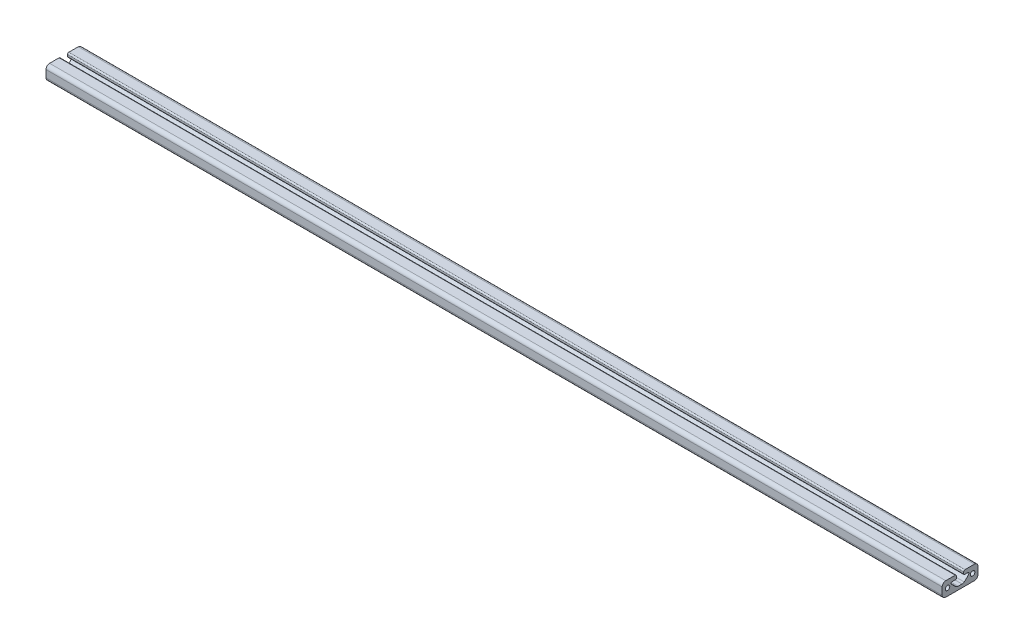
from build123d import *

# Parameters (mm, degrees)
MODEL_R                = 2.5
STRUKTURBAUTEIL1_DEPTH = 1000


with BuildPart() as part:
    # Model → Strukturbauteil1 (new body)
    with BuildSketch(Plane(origin=(0, 0, 0), x_dir=(0, 0, -1), z_dir=(1, 0, 0))):
        with BuildLine():
            Line((-8.91611505, 3.5), (-5, 3.5))
            ThreePointArc((-5, 3.5), (-4.292893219, 3.792893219), (-4, 4.5))
            Line((-4, 4.5), (-4, 6.5))
            ThreePointArc((-4, 6.5), (-4.439339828, 7.560660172), (-5.5, 8))
            Line((-5.5, 8), (-16, 8))
            ThreePointArc((-16, 8), (-18.828427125, 6.828427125), (-20, 4))
            Line((-20, 4), (-20, -4))
            ThreePointArc((-20, -4), (-18.828427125, -6.828427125), (-16, -8))
            Line((-16, -8), (16, -8))
            ThreePointArc((16, -8), (18.828427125, -6.828427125), (20, -4))
            Line((20, -4), (20, 4))
            ThreePointArc((20, 4), (18.828427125, 6.828427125), (16, 8))
            Line((16, 8), (5.5, 8))
            ThreePointArc((5.5, 8), (4.439339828, 7.560660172), (4, 6.5))
            Line((4, 6.5), (4, 4.5))
            ThreePointArc((4, 4.5), (4.292893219, 3.792893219), (5, 3.5))
            Line((5, 3.5), (8.91611505, 3.5))
            ThreePointArc((8.91611505, 3.5), (9.883468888, 2.905025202), (9.788807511, 1.773297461))
            ThreePointArc((9.788807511, 1.773297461), (7.378794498, -1.036448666), (4.580305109, -3.45952381))
            ThreePointArc((4.580305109, -3.45952381), (3.45041558, -4.047242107), (2.193056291, -4.25))
            Line((2.193056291, -4.25), (-2.193056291, -4.25))
            ThreePointArc((-2.193056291, -4.25), (-3.45041558, -4.047242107), (-4.580305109, -3.45952381))
            ThreePointArc((-4.580305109, -3.45952381), (-7.378794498, -1.036448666), (-9.788807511, 1.773297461))
            ThreePointArc((-9.788807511, 1.773297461), (-9.883468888, 2.905025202), (-8.91611505, 3.5))
        make_face()
        with Locations((14, 0)):
            Circle(MODEL_R, mode=Mode.SUBTRACT)
        with Locations((-14, 0)):
            Circle(MODEL_R, mode=Mode.SUBTRACT)
    extrude(amount=STRUKTURBAUTEIL1_DEPTH)


solid = part.part
